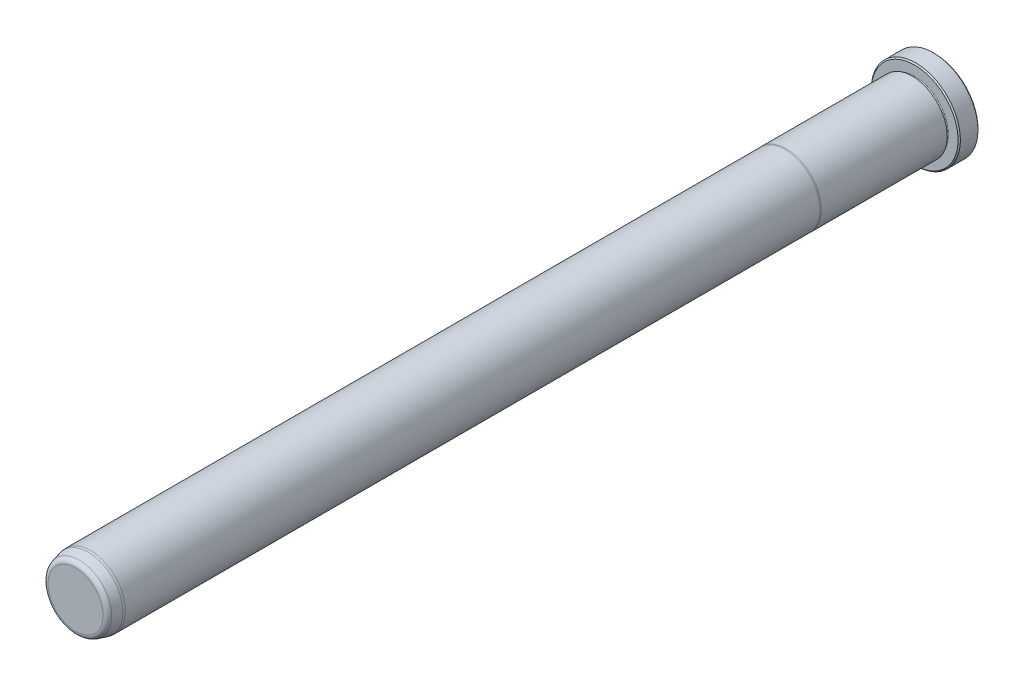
from build123d import *

# Parameters (mm, degrees)
FILLET6_R     = 1.5875
CHAMFER1_SIZE = 0.381


with BuildPart() as part:
    # Sketch1 → Revolve1 (revolve)
    with BuildSketch(Plane(origin=(0, 0, 0), x_dir=(0, 0, -1), z_dir=(1, 0, 0)), mode=Mode.PRIVATE) as revolve1_sk:
        with BuildLine():
            Line((0, 0), (0, 14.1605))
            Line((0, 14.1605), (-6.35, 14.1605))
            Line((-6.35, 14.1605), (-6.35, 10.7188))
            ThreePointArc((-6.35, 10.7188), (-6.731, 10.3378), (-7.112, 10.7188))
            Line((-7.112, 10.7188), (-7.112, 11.1252))
            Line((-7.112, 11.1252), (-47.134763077, 11.1252))
            Line((-47.134763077, 11.1252), (-47.498, 11.0998))
            Line((-47.498, 11.0998), (-268.2875, 11.0998))
            Line((-268.2875, 11.0998), (-269.0495, 11.033133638))
            Line((-269.0495, 11.033133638), (-273.05, 9.961202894))
            Line((-273.05, 9.961202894), (-273.05, 0))
            Line((-273.05, 0), (0, 0))
        make_face()
    revolve(revolve1_sk.sketch.rotate(Axis((0, 0, 0), (0, 0, -1)), 90), axis=Axis((0, 0, 0), (0, 0, -1)))

    # Fillet6
    fillet6_edges = [part.edges().sort_by_distance(p)[0] for p in [
        (-9.961202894, 0, 273.05),
    ]]
    fillet(fillet6_edges, radius=FILLET6_R)

    # Chamfer1
    chamfer1_edges = [part.edges().sort_by_distance(p)[0] for p in [
        (-14.1605, 0, 6.35),
        (-14.1605, 0, 0),
    ]]
    chamfer(chamfer1_edges, length=CHAMFER1_SIZE)


solid = part.part
